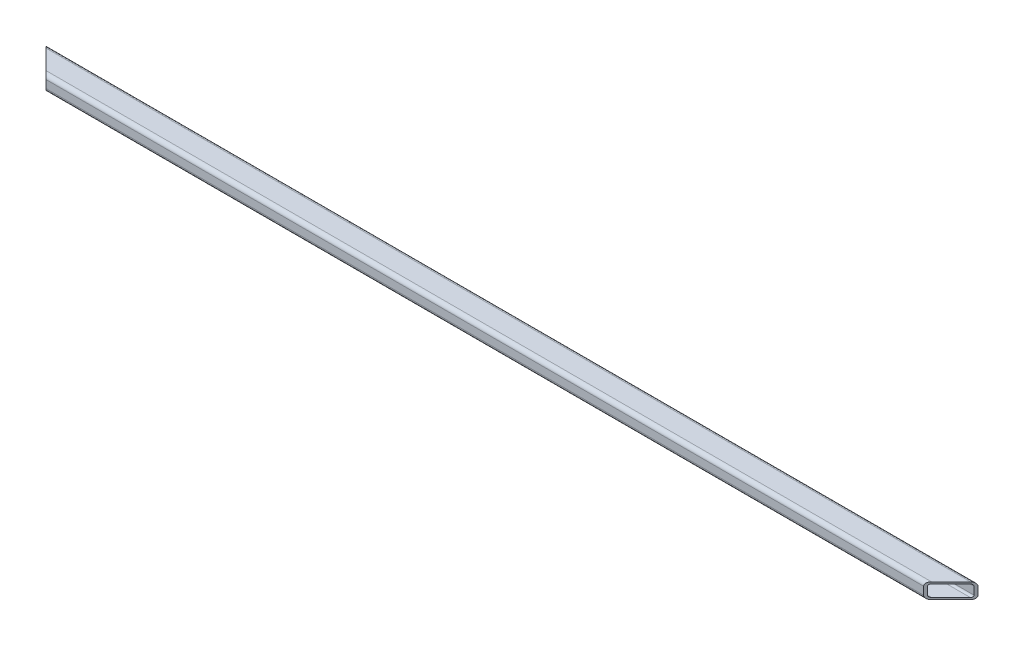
from build123d import *

# Parameters (mm, degrees)
BASE_EXTRUSION_DEPTH    = 1200
ENL_V_MAT_EXTRU_1_DEPTH = 1201.294234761
ENL_V_MAT_EXTRU_3_DEPTH = 1201.294234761


with BuildPart() as part:
    # Esquisse1 → Base-Extrusion (new body)
    with BuildSketch(Plane(origin=(0, 0, 0), x_dir=(0, 0, -1), z_dir=(1, 0, 0))):
        with BuildLine():
            Line((-12.5, 10), (12.5, 10))
            ThreePointArc((12.5, 10), (16.035533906, 8.535533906), (17.5, 5))
            Line((17.5, 5), (17.5, -5))
            ThreePointArc((17.5, -5), (16.035533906, -8.535533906), (12.5, -10))
            Line((12.5, -10), (-12.5, -10))
            ThreePointArc((-12.5, -10), (-16.035533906, -8.535533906), (-17.5, -5))
            Line((-17.5, -5), (-17.5, 5))
            ThreePointArc((-17.5, 5), (-16.035533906, 8.535533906), (-12.5, 10))
        make_face()
        with BuildLine():
            Line((-12.5, 7.5), (12.5, 7.5))
            ThreePointArc((12.5, 7.5), (14.267766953, 6.767766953), (15, 5))
            Line((15, 5), (15, -5))
            ThreePointArc((15, -5), (14.267766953, -6.767766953), (12.5, -7.5))
            Line((12.5, -7.5), (-12.5, -7.5))
            ThreePointArc((-12.5, -7.5), (-14.267766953, -6.767766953), (-15, -5))
            Line((-15, -5), (-15, 5))
            ThreePointArc((-15, 5), (-14.267766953, 6.767766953), (-12.5, 7.5))
        make_face(mode=Mode.SUBTRACT)
    extrude(amount=BASE_EXTRUSION_DEPTH)

    # Esquisse2 → Enl_v. mat.-Extru.1 (cut, through all)
    with BuildSketch(Plane(origin=(0, 10, 0), x_dir=(-1, 0, 0), z_dir=(0, 1, 0))):
        Polygon((-1200, 17.5), (-1200, -17.5), (-1165, 17.5), align=None)
    extrude(amount=-ENL_V_MAT_EXTRU_1_DEPTH, mode=Mode.SUBTRACT)

    # Esquisse3 → Enl_v. mat.-Extru.3 (cut, through all)
    with BuildSketch(Plane(origin=(0, 10, 0), x_dir=(-1, 0, 0), z_dir=(0, 1, 0))):
        Polygon((0, -17.5), (-35, 17.5), (0, 17.5), align=None)
    extrude(amount=-ENL_V_MAT_EXTRU_3_DEPTH, mode=Mode.SUBTRACT)


solid = part.part
